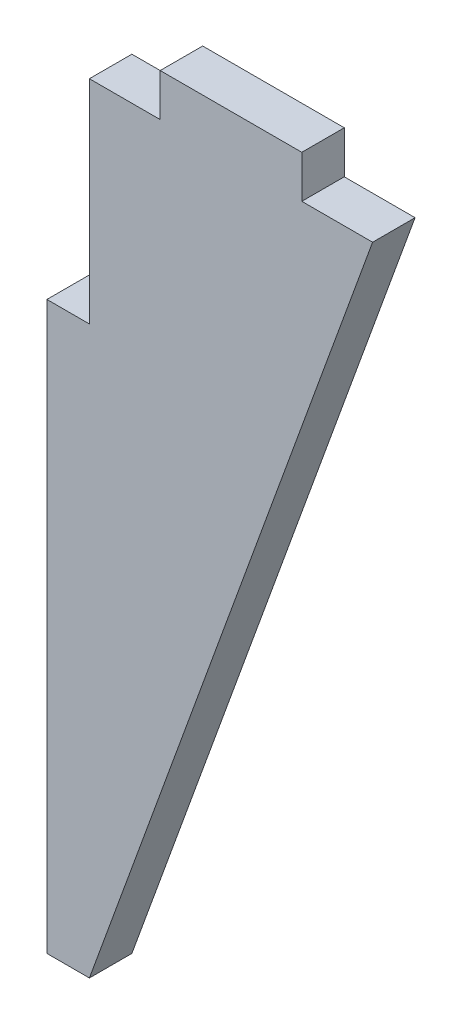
from build123d import *

# Parameters (mm, degrees)
BOSS_EXTRU_1_DEPTH = 3


with BuildPart() as part:
    # Esquisse1 → Boss.-Extru.1 (new body)
    with BuildSketch(Plane.XY):
        Polygon((-67, -55), (-70, -55), (-70, -15), (-67, -15), (-67, 0), (-62, 0), (-62, 3), (-52, 3), (-52, 0), (-47, 0), align=None)
    extrude(amount=BOSS_EXTRU_1_DEPTH)


solid = part.part
